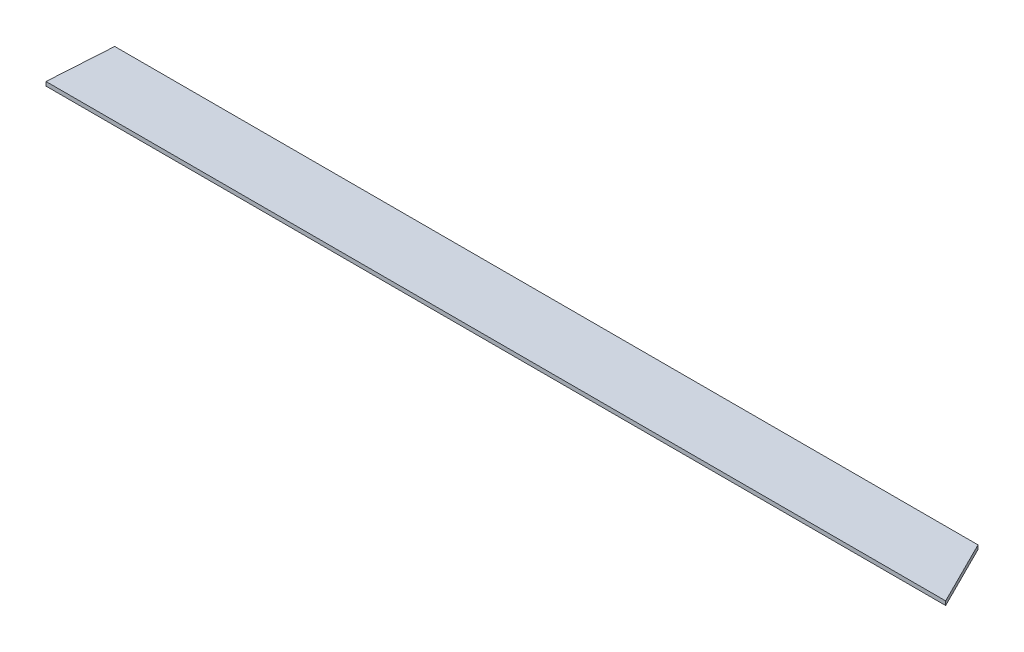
ISO-10303-21;
HEADER;
FILE_DESCRIPTION(('STEP AP214'),'2;1');
FILE_NAME('part.step','',(''),(''),'','','');
FILE_SCHEMA(('AUTOMOTIVE_DESIGN { 1 0 10303 214 1 1 1 1 }'));
ENDSEC;
DATA;
#1=APPLICATION_CONTEXT('core data for automotive mechanical design processes');
#2=APPLICATION_PROTOCOL_DEFINITION('international standard','automotive_design',2000,#1);
#3=PRODUCT_CONTEXT('',#1,'mechanical');
#4=PRODUCT('Part','Part','',(#3));
#5=PRODUCT_RELATED_PRODUCT_CATEGORY('part','',(#4));
#6=PRODUCT_DEFINITION_FORMATION('','',#4);
#7=PRODUCT_DEFINITION_CONTEXT('part definition',#1,'design');
#8=PRODUCT_DEFINITION('design','',#6,#7);
#9=PRODUCT_DEFINITION_SHAPE('','',#8);
#10=(LENGTH_UNIT() NAMED_UNIT(*) SI_UNIT(.MILLI.,.METRE.));
#11=(NAMED_UNIT(*) PLANE_ANGLE_UNIT() SI_UNIT($,.RADIAN.));
#12=(NAMED_UNIT(*) SI_UNIT($,.STERADIAN.) SOLID_ANGLE_UNIT());
#13=UNCERTAINTY_MEASURE_WITH_UNIT(LENGTH_MEASURE(1.E-05),#10,'distance_accuracy_value','');
#14=(GEOMETRIC_REPRESENTATION_CONTEXT(3) GLOBAL_UNCERTAINTY_ASSIGNED_CONTEXT((#13)) GLOBAL_UNIT_ASSIGNED_CONTEXT((#10,
#11,#12)) REPRESENTATION_CONTEXT('',''));
#15=CARTESIAN_POINT('',(0.,0.,0.));
#16=DIRECTION('',(0.,0.,1.));
#17=DIRECTION('',(1.,0.,0.));
#18=AXIS2_PLACEMENT_3D('',#15,#16,#17);
#19=CARTESIAN_POINT('',(666.97938646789,6.35,-49.751376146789));
#20=DIRECTION('',(-0.894427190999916,0.,0.447213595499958));
#21=DIRECTION('',(0.447213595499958,0.,0.894427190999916));
#22=AXIS2_PLACEMENT_3D('',#19,#20,#21);
#23=PLANE('',#22);
#24=DIRECTION('',(-0.447213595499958,0.,-0.894427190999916));
#25=VECTOR('',#24,1.);
#26=CARTESIAN_POINT('',(666.97938646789,0.,-49.751376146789));
#27=LINE('',#26,#25);
#28=CARTESIAN_POINT('',(717.77938646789,0.,51.848623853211));
#29=VERTEX_POINT('',#28);
#30=CARTESIAN_POINT('',(666.97938646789,0.,-49.751376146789));
#31=VERTEX_POINT('',#30);
#32=EDGE_CURVE('E97',#29,#31,#27,.T.);
#33=ORIENTED_EDGE('',*,*,#32,.T.);
#34=DIRECTION('',(0.,-1.,0.));
#35=VECTOR('',#34,1.);
#36=CARTESIAN_POINT('',(666.97938646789,6.35,-49.751376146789));
#37=LINE('',#36,#35);
#38=CARTESIAN_POINT('',(666.97938646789,6.35,-49.751376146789));
#39=VERTEX_POINT('',#38);
#40=EDGE_CURVE('E11',#39,#31,#37,.T.);
#41=ORIENTED_EDGE('',*,*,#40,.F.);
#42=DIRECTION('',(-0.447213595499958,0.,-0.894427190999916));
#43=VECTOR('',#42,1.);
#44=CARTESIAN_POINT('',(666.97938646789,6.35,-49.751376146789));
#45=LINE('',#44,#43);
#46=CARTESIAN_POINT('',(717.77938646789,6.35,51.848623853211));
#47=VERTEX_POINT('',#46);
#48=EDGE_CURVE('E85',#47,#39,#45,.T.);
#49=ORIENTED_EDGE('',*,*,#48,.F.);
#50=DIRECTION('',(0.,-1.,0.));
#51=VECTOR('',#50,1.);
#52=CARTESIAN_POINT('',(717.77938646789,6.35,51.848623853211));
#53=LINE('',#52,#51);
#54=EDGE_CURVE('E93',#47,#29,#53,.T.);
#55=ORIENTED_EDGE('',*,*,#54,.T.);
#56=EDGE_LOOP('',(#33,#41,#49,#55));
#57=FACE_BOUND('',#56,.T.);
#58=ADVANCED_FACE('F34',(#57),#23,.F.);
#59=CARTESIAN_POINT('',(-688.74561353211,6.35,-49.751376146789));
#60=DIRECTION('',(0.,0.,1.));
#61=DIRECTION('',(1.,0.,0.));
#62=AXIS2_PLACEMENT_3D('',#59,#60,#61);
#63=PLANE('',#62);
#64=DIRECTION('',(-1.,0.,0.));
#65=VECTOR('',#64,1.);
#66=CARTESIAN_POINT('',(-688.74561353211,0.,-49.751376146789));
#67=LINE('',#66,#65);
#68=CARTESIAN_POINT('',(-688.74561353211,0.,-49.751376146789));
#69=VERTEX_POINT('',#68);
#70=EDGE_CURVE('E89',#31,#69,#67,.T.);
#71=ORIENTED_EDGE('',*,*,#70,.T.);
#72=DIRECTION('',(0.,-1.,0.));
#73=VECTOR('',#72,1.);
#74=CARTESIAN_POINT('',(-688.74561353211,6.35,-49.751376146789));
#75=LINE('',#74,#73);
#76=CARTESIAN_POINT('',(-688.74561353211,6.35,-49.751376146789));
#77=VERTEX_POINT('',#76);
#78=EDGE_CURVE('E42',#77,#69,#75,.T.);
#79=ORIENTED_EDGE('',*,*,#78,.F.);
#80=DIRECTION('',(-1.,0.,0.));
#81=VECTOR('',#80,1.);
#82=CARTESIAN_POINT('',(-688.74561353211,6.35,-49.751376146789));
#83=LINE('',#82,#81);
#84=EDGE_CURVE('E80',#39,#77,#83,.T.);
#85=ORIENTED_EDGE('',*,*,#84,.F.);
#86=ORIENTED_EDGE('',*,*,#40,.T.);
#87=EDGE_LOOP('',(#71,#79,#85,#86));
#88=FACE_BOUND('',#87,.T.);
#89=ADVANCED_FACE('F88',(#88),#63,.F.);
#90=CARTESIAN_POINT('',(-688.74561353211,6.35,-49.751376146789));
#91=DIRECTION('',(0.998052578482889,0.,0.0623782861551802));
#92=DIRECTION('',(0.0623782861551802,0.,-0.998052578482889));
#93=AXIS2_PLACEMENT_3D('',#90,#91,#92);
#94=PLANE('',#93);
#95=DIRECTION('',(-0.0623782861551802,0.,0.998052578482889));
#96=VECTOR('',#95,1.);
#97=CARTESIAN_POINT('',(-688.74561353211,0.,-49.751376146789));
#98=LINE('',#97,#96);
#99=CARTESIAN_POINT('',(-695.09561353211,0.,51.848623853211));
#100=VERTEX_POINT('',#99);
#101=EDGE_CURVE('E67',#69,#100,#98,.T.);
#102=ORIENTED_EDGE('',*,*,#101,.T.);
#103=DIRECTION('',(0.,-1.,0.));
#104=VECTOR('',#103,1.);
#105=CARTESIAN_POINT('',(-695.09561353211,6.35,51.848623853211));
#106=LINE('',#105,#104);
#107=CARTESIAN_POINT('',(-695.09561353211,6.35,51.848623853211));
#108=VERTEX_POINT('',#107);
#109=EDGE_CURVE('E90',#108,#100,#106,.T.);
#110=ORIENTED_EDGE('',*,*,#109,.F.);
#111=DIRECTION('',(-0.0623782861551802,0.,0.998052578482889));
#112=VECTOR('',#111,1.);
#113=CARTESIAN_POINT('',(-688.74561353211,6.35,-49.751376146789));
#114=LINE('',#113,#112);
#115=EDGE_CURVE('E83',#77,#108,#114,.T.);
#116=ORIENTED_EDGE('',*,*,#115,.F.);
#117=ORIENTED_EDGE('',*,*,#78,.T.);
#118=EDGE_LOOP('',(#102,#110,#116,#117));
#119=FACE_BOUND('',#118,.T.);
#120=ADVANCED_FACE('F91',(#119),#94,.F.);
#121=CARTESIAN_POINT('',(-695.09561353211,6.35,51.848623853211));
#122=DIRECTION('',(0.,0.,-1.));
#123=DIRECTION('',(-1.,0.,0.));
#124=AXIS2_PLACEMENT_3D('',#121,#122,#123);
#125=PLANE('',#124);
#126=DIRECTION('',(1.,0.,0.));
#127=VECTOR('',#126,1.);
#128=CARTESIAN_POINT('',(-695.09561353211,0.,51.848623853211));
#129=LINE('',#128,#127);
#130=EDGE_CURVE('E73',#100,#29,#129,.T.);
#131=ORIENTED_EDGE('',*,*,#130,.T.);
#132=ORIENTED_EDGE('',*,*,#54,.F.);
#133=DIRECTION('',(1.,0.,0.));
#134=VECTOR('',#133,1.);
#135=CARTESIAN_POINT('',(-695.09561353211,6.35,51.848623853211));
#136=LINE('',#135,#134);
#137=EDGE_CURVE('E50',#108,#47,#136,.T.);
#138=ORIENTED_EDGE('',*,*,#137,.F.);
#139=ORIENTED_EDGE('',*,*,#109,.T.);
#140=EDGE_LOOP('',(#131,#132,#138,#139));
#141=FACE_BOUND('',#140,.T.);
#142=ADVANCED_FACE('F104',(#141),#125,.F.);
#143=CARTESIAN_POINT('',(717.77938646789,6.35,51.848623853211));
#144=DIRECTION('',(0.,1.,0.));
#145=DIRECTION('',(0.,0.,1.));
#146=AXIS2_PLACEMENT_3D('',#143,#144,#145);
#147=PLANE('',#146);
#148=ORIENTED_EDGE('',*,*,#48,.T.);
#149=ORIENTED_EDGE('',*,*,#84,.T.);
#150=ORIENTED_EDGE('',*,*,#115,.T.);
#151=ORIENTED_EDGE('',*,*,#137,.T.);
#152=EDGE_LOOP('',(#148,#149,#150,#151));
#153=FACE_BOUND('',#152,.T.);
#154=ADVANCED_FACE('F81',(#153),#147,.T.);
#155=CARTESIAN_POINT('',(717.77938646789,0.,51.848623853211));
#156=DIRECTION('',(0.,1.,0.));
#157=DIRECTION('',(0.,0.,1.));
#158=AXIS2_PLACEMENT_3D('',#155,#156,#157);
#159=PLANE('',#158);
#160=ORIENTED_EDGE('',*,*,#32,.F.);
#161=ORIENTED_EDGE('',*,*,#130,.F.);
#162=ORIENTED_EDGE('',*,*,#101,.F.);
#163=ORIENTED_EDGE('',*,*,#70,.F.);
#164=EDGE_LOOP('',(#160,#161,#162,#163));
#165=FACE_BOUND('',#164,.T.);
#166=ADVANCED_FACE('F107',(#165),#159,.F.);
#167=CLOSED_SHELL('',(#58,#89,#120,#142,#154,#166));
#168=MANIFOLD_SOLID_BREP('B2',#167);
#169=ADVANCED_BREP_SHAPE_REPRESENTATION('',(#18,#168),#14);
#170=SHAPE_DEFINITION_REPRESENTATION(#9,#169);
ENDSEC;
END-ISO-10303-21;
